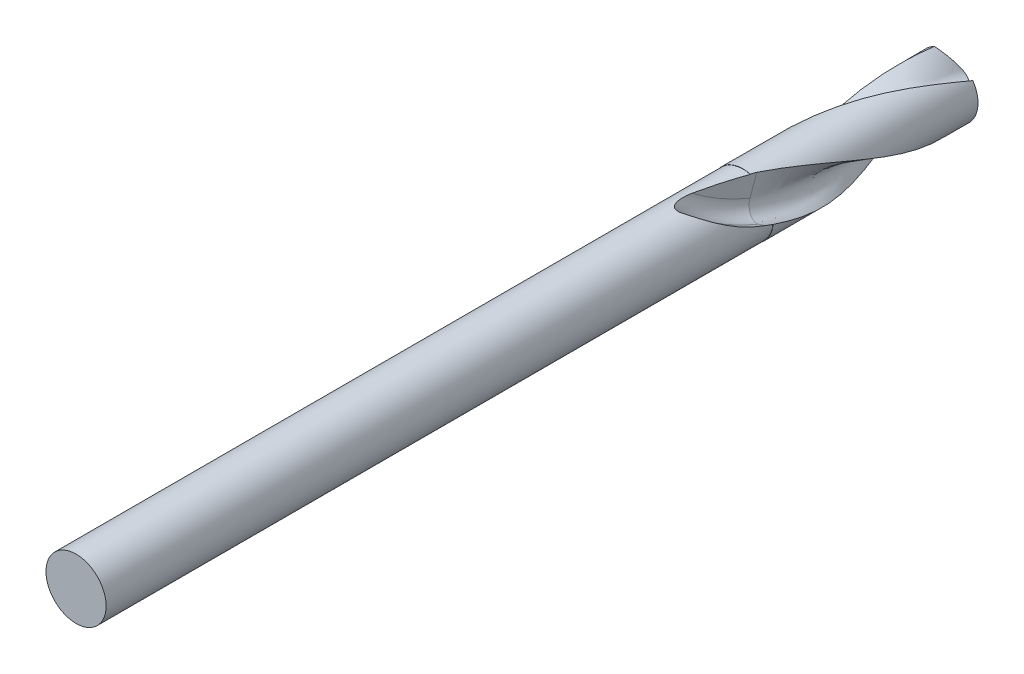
from build123d import *

# Parameters (mm, degrees)
FOPO_DENT_PITCH       = 8.63
FOPO_DENT_HEIGHT      = 4.166666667
FOPO_DENT_RADIUS      = 0.5
FOPO_DENT_START_ANGLE = 135
FOPO_DEG_ANGLE        = 90
REP_COUNT             = 2


with BuildPart() as part:
    # EsqCorps → CorpsOutil (revolve)
    with BuildSketch(Plane(origin=(0, 0, 0), x_dir=(0, 0, -1), z_dir=(1, 0, 0)), mode=Mode.PRIVATE) as corpsoutil_sk:
        Polygon((0, 0), (-14.666666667, 0), (-14.666666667, 0.496), (-3.666666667, 0.496), (-3.666666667, 0.5), (-0.288675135, 0.5), align=None)
    revolve(corpsoutil_sk.sketch.rotate(Axis((0, 0, 0.300640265), (0, 0, -1)), 180), axis=Axis((0, 0, 0.300640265), (0, 0, -1)))

    # FOPO-Dent: sweep along a helix
    with BuildLine() as fopo_dent_path:
        add(Helix(FOPO_DENT_PITCH, FOPO_DENT_HEIGHT, FOPO_DENT_RADIUS, center=(0, 0, 3.666666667), direction=(0, 0, -1), mode=Mode.PRIVATE).rotate(Axis((0, 0, 3.666666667), (0, 0, -1)), FOPO_DENT_START_ANGLE))
    # EsqDent → FOPO-Dent (sweep, cut)
    with BuildSketch(Plane(origin=(0.353553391, 0.353553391, 3.666666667), x_dir=(-0.9656323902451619, 0.03492966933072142, -0.25755388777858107), z_dir=(0.24188076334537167, -0.24188076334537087, -0.9396740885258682))):
        with BuildLine():
            Line((0.229053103, -0.236570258), (0.229053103, 0.618524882))
            ThreePointArc((0.229053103, 0.618524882), (-0.328822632, 0.37666394), (-0.643467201, -0.143644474))
            Line((-0.643467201, -0.143644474), (-0.05547055, -0.417831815))
            ThreePointArc((-0.05547055, -0.417831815), (0.136513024, -0.405248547), (0.229053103, -0.236570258))
        make_face()
    fopo_dent = sweep(path=fopo_dent_path.line, is_frenet=True, mode=Mode.SUBTRACT)

    # EsqDeg → FOPO-Deg (revolve, cut)
    with BuildSketch(Plane(origin=(0.353553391, 0.353553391, 3.666666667), x_dir=(-0.9656323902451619, 0.03492966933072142, -0.25755388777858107), z_dir=(0.24188076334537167, -0.24188076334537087, -0.9396740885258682))):
        with BuildLine():
            Line((0.229053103, -0.236570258), (0.229053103, 0.618524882))
            ThreePointArc((0.229053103, 0.618524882), (-0.328822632, 0.37666394), (-0.643467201, -0.143644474))
            Line((-0.643467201, -0.143644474), (-0.05547055, -0.417831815))
            ThreePointArc((-0.05547055, -0.417831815), (0.136513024, -0.405248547), (0.229053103, -0.236570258))
        make_face()
    fopo_deg = revolve(axis=Axis((1.696882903, 2.371413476, 3.493036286), (-0.9656323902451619, 0.03492966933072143, -0.257553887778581)), revolution_arc=FOPO_DEG_ANGLE, mode=Mode.SUBTRACT)

    # Rep: FOPO-Dent, FOPO-Deg ×2 about axis
    rep_axis = Axis((0, 0, -1.449807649), (0, 0, 1))
    add([fopo_dent.rotate(rep_axis, i * 360 / REP_COUNT) for i in range(1, REP_COUNT)], mode=Mode.SUBTRACT)
    add([fopo_deg.rotate(rep_axis, i * 360 / REP_COUNT) for i in range(1, REP_COUNT)], mode=Mode.SUBTRACT)


solid = part.part
